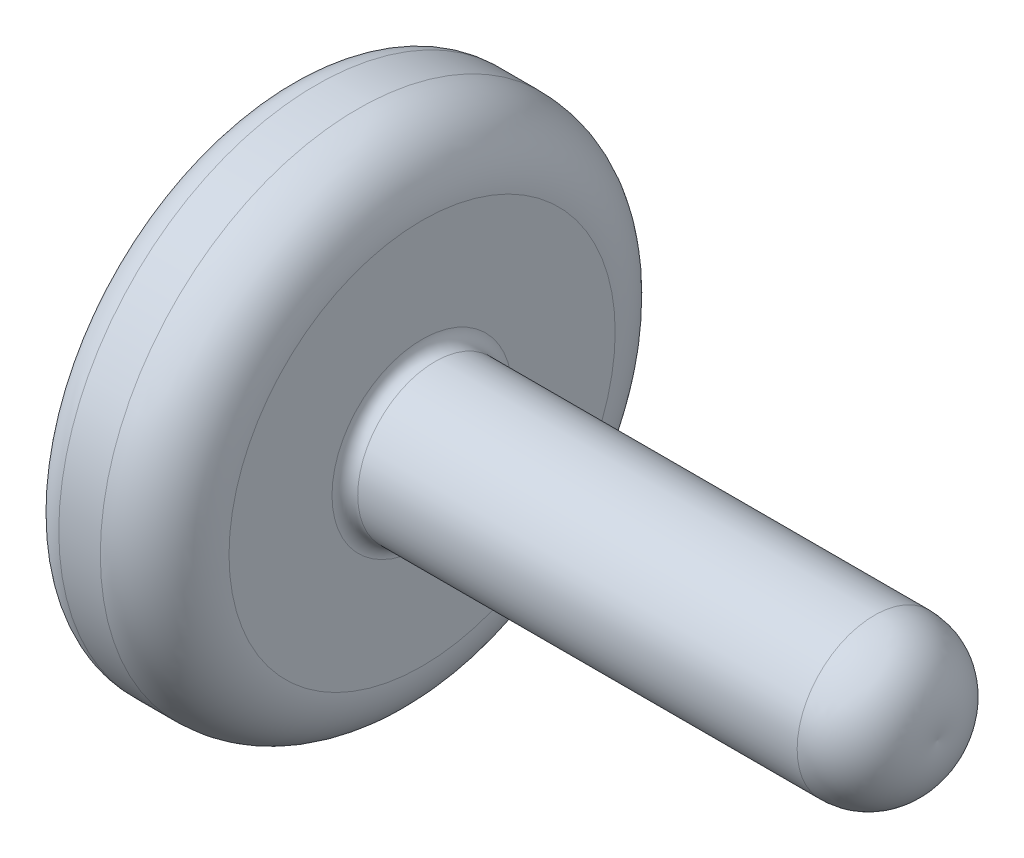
ISO-10303-21;
HEADER;
FILE_DESCRIPTION(('STEP AP214'),'2;1');
FILE_NAME('part.step','',(''),(''),'','','');
FILE_SCHEMA(('AUTOMOTIVE_DESIGN { 1 0 10303 214 1 1 1 1 }'));
ENDSEC;
DATA;
#1=APPLICATION_CONTEXT('core data for automotive mechanical design processes');
#2=APPLICATION_PROTOCOL_DEFINITION('international standard','automotive_design',2000,#1);
#3=PRODUCT_CONTEXT('',#1,'mechanical');
#4=PRODUCT('Part','Part','',(#3));
#5=PRODUCT_RELATED_PRODUCT_CATEGORY('part','',(#4));
#6=PRODUCT_DEFINITION_FORMATION('','',#4);
#7=PRODUCT_DEFINITION_CONTEXT('part definition',#1,'design');
#8=PRODUCT_DEFINITION('design','',#6,#7);
#9=PRODUCT_DEFINITION_SHAPE('','',#8);
#10=(LENGTH_UNIT() NAMED_UNIT(*) SI_UNIT(.MILLI.,.METRE.));
#11=(NAMED_UNIT(*) PLANE_ANGLE_UNIT() SI_UNIT($,.RADIAN.));
#12=(NAMED_UNIT(*) SI_UNIT($,.STERADIAN.) SOLID_ANGLE_UNIT());
#13=UNCERTAINTY_MEASURE_WITH_UNIT(LENGTH_MEASURE(1.E-05),#10,'distance_accuracy_value','');
#14=(GEOMETRIC_REPRESENTATION_CONTEXT(3) GLOBAL_UNCERTAINTY_ASSIGNED_CONTEXT((#13)) GLOBAL_UNIT_ASSIGNED_CONTEXT((#10,
#11,#12)) REPRESENTATION_CONTEXT('',''));
#15=CARTESIAN_POINT('',(0.,0.,0.));
#16=DIRECTION('',(0.,0.,1.));
#17=DIRECTION('',(1.,0.,0.));
#18=AXIS2_PLACEMENT_3D('',#15,#16,#17);
#19=CARTESIAN_POINT('',(4.,0.,0.));
#20=DIRECTION('',(-1.,0.,0.));
#21=DIRECTION('',(0.,1.,0.));
#22=AXIS2_PLACEMENT_3D('',#19,#20,#21);
#23=SPHERICAL_SURFACE('',#22,4.);
#24=CARTESIAN_POINT('',(0.465266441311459,0.,0.));
#25=DIRECTION('',(-1.,0.,0.));
#26=DIRECTION('',(0.,0.,1.));
#27=AXIS2_PLACEMENT_3D('',#24,#25,#26);
#28=CIRCLE('',#27,1.87234042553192);
#29=CARTESIAN_POINT('',(0.465266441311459,0.,1.87234042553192));
#30=VERTEX_POINT('',#29);
#31=EDGE_CURVE('E321',#30,#30,#28,.T.);
#32=ORIENTED_EDGE('',*,*,#31,.T.);
#33=EDGE_LOOP('',(#32));
#34=FACE_BOUND('',#33,.T.);
#35=CARTESIAN_POINT('',(0.0543400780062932,0.,0.));
#36=DIRECTION('',(1.,0.,0.));
#37=DIRECTION('',(0.,0.,-1.));
#38=AXIS2_PLACEMENT_3D('',#35,#36,#37);
#39=CIRCLE('',#38,0.657090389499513);
#40=CARTESIAN_POINT('',(0.0543400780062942,-0.369999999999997,-0.543017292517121));
#41=VERTEX_POINT('',#40);
#42=CARTESIAN_POINT('',(0.0543400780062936,-0.543017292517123,-0.37));
#43=VERTEX_POINT('',#42);
#44=EDGE_CURVE('E457',#41,#43,#39,.F.);
#45=ORIENTED_EDGE('',*,*,#44,.F.);
#46=CARTESIAN_POINT('',(4.,-0.37,0.));
#47=DIRECTION('',(0.,1.,0.));
#48=DIRECTION('',(0.,0.,1.));
#49=AXIS2_PLACEMENT_3D('',#46,#47,#48);
#50=CIRCLE('',#49,3.98285073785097);
#51=CARTESIAN_POINT('',(0.201999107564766,-0.369999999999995,-1.19928696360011));
#52=VERTEX_POINT('',#51);
#53=EDGE_CURVE('E283',#52,#41,#50,.T.);
#54=ORIENTED_EDGE('',*,*,#53,.F.);
#55=CARTESIAN_POINT('',(3.72274316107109,0.,0.556091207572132));
#56=DIRECTION('',(0.446197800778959,0.,-0.89493436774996));
#57=DIRECTION('',(-0.89493436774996,0.,-0.446197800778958));
#58=AXIS2_PLACEMENT_3D('',#55,#56,#57);
#59=CIRCLE('',#58,3.95144166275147);
#60=CARTESIAN_POINT('',(0.201999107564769,0.370000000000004,-1.19928696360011));
#61=VERTEX_POINT('',#60);
#62=EDGE_CURVE('E255',#52,#61,#59,.T.);
#63=ORIENTED_EDGE('',*,*,#62,.T.);
#64=CARTESIAN_POINT('',(4.,0.37,0.));
#65=DIRECTION('',(0.,-1.,0.));
#66=DIRECTION('',(0.,0.,-1.));
#67=AXIS2_PLACEMENT_3D('',#64,#65,#66);
#68=CIRCLE('',#67,3.98285073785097);
#69=CARTESIAN_POINT('',(0.0543400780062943,0.370000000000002,-0.543017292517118));
#70=VERTEX_POINT('',#69);
#71=EDGE_CURVE('E291',#70,#61,#68,.T.);
#72=ORIENTED_EDGE('',*,*,#71,.F.);
#73=CARTESIAN_POINT('',(0.0543400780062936,0.543017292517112,-0.37));
#74=VERTEX_POINT('',#73);
#75=EDGE_CURVE('E370',#74,#70,#39,.F.);
#76=ORIENTED_EDGE('',*,*,#75,.F.);
#77=CARTESIAN_POINT('',(4.,0.,-0.37));
#78=DIRECTION('',(0.,0.,1.));
#79=DIRECTION('',(0.,-1.,0.));
#80=AXIS2_PLACEMENT_3D('',#77,#78,#79);
#81=CIRCLE('',#80,3.98285073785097);
#82=CARTESIAN_POINT('',(0.201999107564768,1.19928696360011,-0.37));
#83=VERTEX_POINT('',#82);
#84=EDGE_CURVE('E249',#83,#74,#81,.T.);
#85=ORIENTED_EDGE('',*,*,#84,.F.);
#86=CARTESIAN_POINT('',(3.72274316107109,-0.556091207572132,0.));
#87=DIRECTION('',(0.446197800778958,0.89493436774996,0.));
#88=DIRECTION('',(-0.89493436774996,0.446197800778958,0.));
#89=AXIS2_PLACEMENT_3D('',#86,#87,#88);
#90=CIRCLE('',#89,3.95144166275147);
#91=CARTESIAN_POINT('',(0.201999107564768,1.19928696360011,0.369999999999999));
#92=VERTEX_POINT('',#91);
#93=EDGE_CURVE('E252',#83,#92,#90,.T.);
#94=ORIENTED_EDGE('',*,*,#93,.T.);
#95=CARTESIAN_POINT('',(4.,0.,0.37));
#96=DIRECTION('',(0.,0.,-1.));
#97=DIRECTION('',(0.,1.,0.));
#98=AXIS2_PLACEMENT_3D('',#95,#96,#97);
#99=CIRCLE('',#98,3.98285073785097);
#100=CARTESIAN_POINT('',(0.0543400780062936,0.543017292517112,0.37));
#101=VERTEX_POINT('',#100);
#102=EDGE_CURVE('E245',#101,#92,#99,.T.);
#103=ORIENTED_EDGE('',*,*,#102,.F.);
#104=CARTESIAN_POINT('',(0.054340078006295,0.369999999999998,0.54301729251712));
#105=VERTEX_POINT('',#104);
#106=EDGE_CURVE('E403',#105,#101,#39,.F.);
#107=ORIENTED_EDGE('',*,*,#106,.F.);
#108=CARTESIAN_POINT('',(0.201999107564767,0.369999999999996,1.19928696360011));
#109=VERTEX_POINT('',#108);
#110=EDGE_CURVE('E265',#109,#105,#68,.T.);
#111=ORIENTED_EDGE('',*,*,#110,.F.);
#112=CARTESIAN_POINT('',(3.72274316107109,0.,-0.556091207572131));
#113=DIRECTION('',(0.446197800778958,0.,0.89493436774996));
#114=DIRECTION('',(0.89493436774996,0.,-0.446197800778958));
#115=AXIS2_PLACEMENT_3D('',#112,#113,#114);
#116=CIRCLE('',#115,3.95144166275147);
#117=CARTESIAN_POINT('',(0.201999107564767,-0.370000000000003,1.19928696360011));
#118=VERTEX_POINT('',#117);
#119=EDGE_CURVE('E40',#109,#118,#116,.T.);
#120=ORIENTED_EDGE('',*,*,#119,.T.);
#121=CARTESIAN_POINT('',(0.0543400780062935,-0.370000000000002,0.543017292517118));
#122=VERTEX_POINT('',#121);
#123=EDGE_CURVE('E262',#122,#118,#50,.T.);
#124=ORIENTED_EDGE('',*,*,#123,.F.);
#125=CARTESIAN_POINT('',(0.0543400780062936,-0.543017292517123,0.369999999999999));
#126=VERTEX_POINT('',#125);
#127=EDGE_CURVE('E442',#126,#122,#39,.F.);
#128=ORIENTED_EDGE('',*,*,#127,.F.);
#129=CARTESIAN_POINT('',(0.201999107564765,-1.19928696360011,0.369999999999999));
#130=VERTEX_POINT('',#129);
#131=EDGE_CURVE('E246',#130,#126,#99,.T.);
#132=ORIENTED_EDGE('',*,*,#131,.F.);
#133=CARTESIAN_POINT('',(3.72274316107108,0.556091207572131,0.));
#134=DIRECTION('',(0.446197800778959,-0.89493436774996,0.));
#135=DIRECTION('',(0.89493436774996,0.446197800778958,0.));
#136=AXIS2_PLACEMENT_3D('',#133,#134,#135);
#137=CIRCLE('',#136,3.95144166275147);
#138=CARTESIAN_POINT('',(0.201999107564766,-1.19928696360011,-0.37));
#139=VERTEX_POINT('',#138);
#140=EDGE_CURVE('E242',#130,#139,#137,.T.);
#141=ORIENTED_EDGE('',*,*,#140,.T.);
#142=EDGE_CURVE('E55',#43,#139,#81,.T.);
#143=ORIENTED_EDGE('',*,*,#142,.F.);
#144=EDGE_LOOP('',(#45,#54,#63,#72,#76,#85,#94,#103,#107,#111,#120,#124,#128,#132,#141,#143));
#145=FACE_BOUND('',#144,.T.);
#146=ADVANCED_FACE('F27',(#34,#145),#23,.T.);
#147=CARTESIAN_POINT('',(1.5,0.552127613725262,-0.37));
#148=DIRECTION('',(0.,0.,1.));
#149=DIRECTION('',(0.,-1.,0.));
#150=AXIS2_PLACEMENT_3D('',#147,#148,#149);
#151=PLANE('',#150);
#152=ORIENTED_EDGE('',*,*,#84,.T.);
#153=CARTESIAN_POINT('',(-0.984107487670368,0.62894390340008,-0.37));
#154=CARTESIAN_POINT('',(-0.783603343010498,0.61266994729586,-0.37));
#155=CARTESIAN_POINT('',(-0.583110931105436,0.596248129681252,-0.37));
#156=CARTESIAN_POINT('',(-0.18215578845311,0.562989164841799,-0.37));
#157=CARTESIAN_POINT('',(0.0183069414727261,0.546152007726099,-0.37));
#158=CARTESIAN_POINT('',(0.419186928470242,0.511943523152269,-0.37));
#159=CARTESIAN_POINT('',(0.619604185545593,0.494572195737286,-0.37));
#160=CARTESIAN_POINT('',(1.02037173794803,0.459102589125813,-0.37));
#161=CARTESIAN_POINT('',(1.2207220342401,0.441004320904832,-0.37));
#162=CARTESIAN_POINT('',(1.53631168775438,0.411665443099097,-0.37));
#163=CARTESIAN_POINT('',(1.65158348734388,0.400774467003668,-0.37));
#164=CARTESIAN_POINT('',(1.88208360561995,0.378547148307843,-0.37));
#165=CARTESIAN_POINT('',(1.99731192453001,0.367210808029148,-0.37));
#166=CARTESIAN_POINT('',(2.22771614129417,0.343963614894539,-0.37));
#167=CARTESIAN_POINT('',(2.34289203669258,0.332052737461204,-0.37));
#168=CARTESIAN_POINT('',(2.57315819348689,0.307413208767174,-0.37));
#169=CARTESIAN_POINT('',(2.68824845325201,0.294684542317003,-0.37));
#170=CARTESIAN_POINT('',(2.80327961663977,0.281425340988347,-0.37));
#171=B_SPLINE_CURVE_WITH_KNOTS('',3,(#153,#154,#155,#156,#157,#158,#159,#160,#161,#162,#163,
#164,#165,#166,#167,#168,#169,#170),.UNSPECIFIED.,.F.,.F.,(4,2,2,2,2,2,2,2,4),(0.,
0.603490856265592,1.20699609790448,1.81050129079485,2.41399737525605,2.76135214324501,
3.1087051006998,3.45607293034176,3.80344721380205),.UNSPECIFIED.);
#172=CARTESIAN_POINT('',(1.5,0.415013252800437,-0.370000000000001));
#173=VERTEX_POINT('',#172);
#174=EDGE_CURVE('E363',#74,#173,#171,.T.);
#175=ORIENTED_EDGE('',*,*,#174,.T.);
#176=DIRECTION('',(0.,1.,0.));
#177=VECTOR('',#176,1.);
#178=CARTESIAN_POINT('',(1.5,-0.552127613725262,-0.37));
#179=LINE('',#178,#177);
#180=CARTESIAN_POINT('',(1.5,0.552127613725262,-0.37));
#181=VERTEX_POINT('',#180);
#182=EDGE_CURVE('E308',#173,#181,#179,.T.);
#183=ORIENTED_EDGE('',*,*,#182,.T.);
#184=DIRECTION('',(0.89493436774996,-0.446197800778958,0.));
#185=VECTOR('',#184,1.);
#186=CARTESIAN_POINT('',(0.,1.3,-0.37));
#187=LINE('',#186,#185);
#188=EDGE_CURVE('E314',#83,#181,#187,.T.);
#189=ORIENTED_EDGE('',*,*,#188,.F.);
#190=EDGE_LOOP('',(#152,#175,#183,#189));
#191=FACE_BOUND('',#190,.T.);
#192=ADVANCED_FACE('F188',(#191),#151,.T.);
#193=CARTESIAN_POINT('',(1.5,-0.552127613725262,-0.37));
#194=VERTEX_POINT('',#193);
#195=CARTESIAN_POINT('',(1.5,-0.415013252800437,-0.370000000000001));
#196=VERTEX_POINT('',#195);
#197=EDGE_CURVE('E305',#194,#196,#179,.T.);
#198=ORIENTED_EDGE('',*,*,#197,.T.);
#199=CARTESIAN_POINT('',(-0.984107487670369,-0.62894390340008,-0.37));
#200=CARTESIAN_POINT('',(-0.783603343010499,-0.61266994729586,-0.37));
#201=CARTESIAN_POINT('',(-0.583110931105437,-0.596248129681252,-0.37));
#202=CARTESIAN_POINT('',(-0.182155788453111,-0.562989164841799,-0.37));
#203=CARTESIAN_POINT('',(0.0183069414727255,-0.5461520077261,-0.37));
#204=CARTESIAN_POINT('',(0.419186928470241,-0.511943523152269,-0.37));
#205=CARTESIAN_POINT('',(0.619604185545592,-0.494572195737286,-0.37));
#206=CARTESIAN_POINT('',(1.02037173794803,-0.459102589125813,-0.37));
#207=CARTESIAN_POINT('',(1.22072203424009,-0.441004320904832,-0.37));
#208=CARTESIAN_POINT('',(1.53631168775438,-0.411665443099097,-0.37));
#209=CARTESIAN_POINT('',(1.65158348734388,-0.400774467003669,-0.37));
#210=CARTESIAN_POINT('',(1.88208360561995,-0.378547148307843,-0.37));
#211=CARTESIAN_POINT('',(1.99731192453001,-0.367210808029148,-0.37));
#212=CARTESIAN_POINT('',(2.22771614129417,-0.343963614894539,-0.37));
#213=CARTESIAN_POINT('',(2.34289203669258,-0.332052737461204,-0.37));
#214=CARTESIAN_POINT('',(2.57315819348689,-0.307413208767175,-0.37));
#215=CARTESIAN_POINT('',(2.68824845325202,-0.294684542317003,-0.37));
#216=CARTESIAN_POINT('',(2.80327961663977,-0.281425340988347,-0.37));
#217=B_SPLINE_CURVE_WITH_KNOTS('',3,(#199,#200,#201,#202,#203,#204,#205,#206,#207,#208,#209,
#210,#211,#212,#213,#214,#215,#216),.UNSPECIFIED.,.F.,.F.,(4,2,2,2,2,2,2,2,4),(0.,
0.603490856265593,1.20699609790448,1.81050129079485,2.41399737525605,2.76135214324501,
3.1087051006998,3.45607293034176,3.80344721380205),.UNSPECIFIED.);
#218=EDGE_CURVE('E356',#196,#43,#217,.F.);
#219=ORIENTED_EDGE('',*,*,#218,.T.);
#220=ORIENTED_EDGE('',*,*,#142,.T.);
#221=DIRECTION('',(0.89493436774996,0.446197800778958,0.));
#222=VECTOR('',#221,1.);
#223=CARTESIAN_POINT('',(0.,-1.3,-0.37));
#224=LINE('',#223,#222);
#225=EDGE_CURVE('E311',#139,#194,#224,.T.);
#226=ORIENTED_EDGE('',*,*,#225,.T.);
#227=EDGE_LOOP('',(#198,#219,#220,#226));
#228=FACE_BOUND('',#227,.T.);
#229=ADVANCED_FACE('F195',(#228),#151,.T.);
#230=CARTESIAN_POINT('',(1.5,-0.552127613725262,0.369999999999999));
#231=DIRECTION('',(0.,0.,-1.));
#232=DIRECTION('',(0.,1.,0.));
#233=AXIS2_PLACEMENT_3D('',#230,#231,#232);
#234=PLANE('',#233);
#235=DIRECTION('',(0.,-1.,0.));
#236=VECTOR('',#235,1.);
#237=CARTESIAN_POINT('',(1.5,0.552127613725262,0.37));
#238=LINE('',#237,#236);
#239=CARTESIAN_POINT('',(1.5,0.552127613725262,0.37));
#240=VERTEX_POINT('',#239);
#241=CARTESIAN_POINT('',(1.5,0.415013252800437,0.370000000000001));
#242=VERTEX_POINT('',#241);
#243=EDGE_CURVE('E297',#240,#242,#238,.T.);
#244=ORIENTED_EDGE('',*,*,#243,.T.);
#245=CARTESIAN_POINT('',(-0.984107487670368,0.62894390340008,0.37));
#246=CARTESIAN_POINT('',(-0.783603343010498,0.61266994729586,0.37));
#247=CARTESIAN_POINT('',(-0.583110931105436,0.596248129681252,0.37));
#248=CARTESIAN_POINT('',(-0.18215578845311,0.562989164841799,0.37));
#249=CARTESIAN_POINT('',(0.0183069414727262,0.5461520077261,0.37));
#250=CARTESIAN_POINT('',(0.419186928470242,0.511943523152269,0.37));
#251=CARTESIAN_POINT('',(0.619604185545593,0.494572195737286,0.37));
#252=CARTESIAN_POINT('',(1.02037173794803,0.459102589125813,0.37));
#253=CARTESIAN_POINT('',(1.22072203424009,0.441004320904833,0.37));
#254=CARTESIAN_POINT('',(1.53631168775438,0.411665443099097,0.37));
#255=CARTESIAN_POINT('',(1.65158348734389,0.400774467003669,0.37));
#256=CARTESIAN_POINT('',(1.88208360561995,0.378547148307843,0.37));
#257=CARTESIAN_POINT('',(1.99731192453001,0.367210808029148,0.37));
#258=CARTESIAN_POINT('',(2.22771614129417,0.343963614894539,0.37));
#259=CARTESIAN_POINT('',(2.34289203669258,0.332052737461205,0.37));
#260=CARTESIAN_POINT('',(2.57315819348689,0.307413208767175,0.37));
#261=CARTESIAN_POINT('',(2.68824845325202,0.294684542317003,0.37));
#262=CARTESIAN_POINT('',(2.80327961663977,0.281425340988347,0.37));
#263=B_SPLINE_CURVE_WITH_KNOTS('',3,(#245,#246,#247,#248,#249,#250,#251,#252,#253,#254,#255,
#256,#257,#258,#259,#260,#261,#262),.UNSPECIFIED.,.F.,.F.,(4,2,2,2,2,2,2,2,4),(0.,
0.603490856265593,1.20699609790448,1.81050129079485,2.41399737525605,2.76135214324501,
3.1087051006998,3.45607293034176,3.80344721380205),.UNSPECIFIED.);
#264=EDGE_CURVE('E404',#242,#101,#263,.F.);
#265=ORIENTED_EDGE('',*,*,#264,.T.);
#266=ORIENTED_EDGE('',*,*,#102,.T.);
#267=DIRECTION('',(0.89493436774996,-0.446197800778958,0.));
#268=VECTOR('',#267,1.);
#269=CARTESIAN_POINT('',(0.,1.3,0.37));
#270=LINE('',#269,#268);
#271=EDGE_CURVE('E313',#92,#240,#270,.T.);
#272=ORIENTED_EDGE('',*,*,#271,.T.);
#273=EDGE_LOOP('',(#244,#265,#266,#272));
#274=FACE_BOUND('',#273,.T.);
#275=ADVANCED_FACE('F351',(#274),#234,.T.);
#276=ORIENTED_EDGE('',*,*,#131,.T.);
#277=CARTESIAN_POINT('',(-0.984107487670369,-0.62894390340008,0.369999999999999));
#278=CARTESIAN_POINT('',(-0.783603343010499,-0.612669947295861,0.369999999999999));
#279=CARTESIAN_POINT('',(-0.583110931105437,-0.596248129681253,0.369999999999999));
#280=CARTESIAN_POINT('',(-0.18215578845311,-0.5629891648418,0.369999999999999));
#281=CARTESIAN_POINT('',(0.0183069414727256,-0.5461520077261,0.369999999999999));
#282=CARTESIAN_POINT('',(0.419186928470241,-0.511943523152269,0.369999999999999));
#283=CARTESIAN_POINT('',(0.619604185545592,-0.494572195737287,0.369999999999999));
#284=CARTESIAN_POINT('',(1.02037173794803,-0.459102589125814,0.369999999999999));
#285=CARTESIAN_POINT('',(1.22072203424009,-0.441004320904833,0.369999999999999));
#286=CARTESIAN_POINT('',(1.53631168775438,-0.411665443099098,0.369999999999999));
#287=CARTESIAN_POINT('',(1.65158348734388,-0.400774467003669,0.37));
#288=CARTESIAN_POINT('',(1.88208360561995,-0.378547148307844,0.37));
#289=CARTESIAN_POINT('',(1.99731192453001,-0.367210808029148,0.37));
#290=CARTESIAN_POINT('',(2.22771614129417,-0.34396361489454,0.37));
#291=CARTESIAN_POINT('',(2.34289203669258,-0.332052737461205,0.37));
#292=CARTESIAN_POINT('',(2.57315819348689,-0.307413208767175,0.37));
#293=CARTESIAN_POINT('',(2.68824845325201,-0.294684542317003,0.37));
#294=CARTESIAN_POINT('',(2.80327961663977,-0.281425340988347,0.37));
#295=B_SPLINE_CURVE_WITH_KNOTS('',3,(#277,#278,#279,#280,#281,#282,#283,#284,#285,#286,#287,
#288,#289,#290,#291,#292,#293,#294),.UNSPECIFIED.,.F.,.F.,(4,2,2,2,2,2,2,2,4),(0.,
0.603490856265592,1.20699609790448,1.81050129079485,2.41399737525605,2.76135214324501,
3.1087051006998,3.45607293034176,3.80344721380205),.UNSPECIFIED.);
#296=CARTESIAN_POINT('',(1.5,-0.415013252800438,0.37));
#297=VERTEX_POINT('',#296);
#298=EDGE_CURVE('E394',#126,#297,#295,.T.);
#299=ORIENTED_EDGE('',*,*,#298,.T.);
#300=CARTESIAN_POINT('',(1.5,-0.552127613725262,0.369999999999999));
#301=VERTEX_POINT('',#300);
#302=EDGE_CURVE('E300',#297,#301,#238,.T.);
#303=ORIENTED_EDGE('',*,*,#302,.T.);
#304=DIRECTION('',(0.89493436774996,0.446197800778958,0.));
#305=VECTOR('',#304,1.);
#306=CARTESIAN_POINT('',(0.,-1.3,0.369999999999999));
#307=LINE('',#306,#305);
#308=EDGE_CURVE('E295',#130,#301,#307,.T.);
#309=ORIENTED_EDGE('',*,*,#308,.F.);
#310=EDGE_LOOP('',(#276,#299,#303,#309));
#311=FACE_BOUND('',#310,.T.);
#312=ADVANCED_FACE('F347',(#311),#234,.T.);
#313=CARTESIAN_POINT('',(1.5,0.552127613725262,0.37));
#314=DIRECTION('',(0.446197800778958,0.89493436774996,0.));
#315=DIRECTION('',(-0.89493436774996,0.446197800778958,0.));
#316=AXIS2_PLACEMENT_3D('',#313,#314,#315);
#317=PLANE('',#316);
#318=CARTESIAN_POINT('',(2.47007520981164,0.0684659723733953,0.));
#319=DIRECTION('',(0.446197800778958,0.89493436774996,0.));
#320=DIRECTION('',(-0.89493436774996,0.446197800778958,0.));
#321=AXIS2_PLACEMENT_3D('',#318,#319,#320);
#322=ELLIPSE('',#321,1.09405678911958,0.483340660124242);
#323=CARTESIAN_POINT('',(1.5,0.552127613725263,0.0655064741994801));
#324=VERTEX_POINT('',#323);
#325=CARTESIAN_POINT('',(1.5,0.552127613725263,-0.0655064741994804));
#326=VERTEX_POINT('',#325);
#327=EDGE_CURVE('E434',#324,#326,#322,.F.);
#328=ORIENTED_EDGE('',*,*,#327,.F.);
#329=DIRECTION('',(0.,0.,-1.));
#330=VECTOR('',#329,1.);
#331=CARTESIAN_POINT('',(1.5,0.552127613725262,0.37));
#332=LINE('',#331,#330);
#333=EDGE_CURVE('E301',#240,#324,#332,.T.);
#334=ORIENTED_EDGE('',*,*,#333,.F.);
#335=ORIENTED_EDGE('',*,*,#271,.F.);
#336=ORIENTED_EDGE('',*,*,#93,.F.);
#337=ORIENTED_EDGE('',*,*,#188,.T.);
#338=EDGE_CURVE('E304',#326,#181,#332,.T.);
#339=ORIENTED_EDGE('',*,*,#338,.F.);
#340=EDGE_LOOP('',(#328,#334,#335,#336,#337,#339));
#341=FACE_BOUND('',#340,.T.);
#342=ADVANCED_FACE('F344',(#341),#317,.F.);
#343=CARTESIAN_POINT('',(0.,-1.3,-0.37));
#344=DIRECTION('',(0.446197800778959,-0.89493436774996,0.));
#345=DIRECTION('',(0.89493436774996,0.446197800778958,0.));
#346=AXIS2_PLACEMENT_3D('',#343,#344,#345);
#347=PLANE('',#346);
#348=CARTESIAN_POINT('',(2.47007520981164,-0.0684659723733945,0.));
#349=DIRECTION('',(0.446197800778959,-0.89493436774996,0.));
#350=DIRECTION('',(-0.89493436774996,-0.446197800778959,0.));
#351=AXIS2_PLACEMENT_3D('',#348,#349,#350);
#352=ELLIPSE('',#351,1.09405678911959,0.483340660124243);
#353=CARTESIAN_POINT('',(1.5,-0.552127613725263,-0.0655064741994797));
#354=VERTEX_POINT('',#353);
#355=CARTESIAN_POINT('',(1.5,-0.552127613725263,0.0655064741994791));
#356=VERTEX_POINT('',#355);
#357=EDGE_CURVE('E430',#354,#356,#352,.F.);
#358=ORIENTED_EDGE('',*,*,#357,.F.);
#359=DIRECTION('',(0.,0.,1.));
#360=VECTOR('',#359,1.);
#361=CARTESIAN_POINT('',(1.5,-0.552127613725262,-0.37));
#362=LINE('',#361,#360);
#363=EDGE_CURVE('E292',#194,#354,#362,.T.);
#364=ORIENTED_EDGE('',*,*,#363,.F.);
#365=ORIENTED_EDGE('',*,*,#225,.F.);
#366=ORIENTED_EDGE('',*,*,#140,.F.);
#367=ORIENTED_EDGE('',*,*,#308,.T.);
#368=EDGE_CURVE('E296',#356,#301,#362,.T.);
#369=ORIENTED_EDGE('',*,*,#368,.F.);
#370=EDGE_LOOP('',(#358,#364,#365,#366,#367,#369));
#371=FACE_BOUND('',#370,.T.);
#372=ADVANCED_FACE('F346',(#371),#347,.F.);
#373=CARTESIAN_POINT('',(1.5,0.552127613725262,-0.37));
#374=DIRECTION('',(-1.,0.,0.));
#375=DIRECTION('',(0.,0.,1.));
#376=AXIS2_PLACEMENT_3D('',#373,#374,#375);
#377=PLANE('',#376);
#378=DIRECTION('',(0.,1.,0.));
#379=VECTOR('',#378,1.);
#380=CARTESIAN_POINT('',(1.5,-0.370000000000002,0.55212761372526));
#381=LINE('',#380,#379);
#382=CARTESIAN_POINT('',(1.5,-0.370000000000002,0.55212761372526));
#383=VERTEX_POINT('',#382);
#384=CARTESIAN_POINT('',(1.5,-0.0655064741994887,0.552127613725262));
#385=VERTEX_POINT('',#384);
#386=EDGE_CURVE('E498',#383,#385,#381,.T.);
#387=ORIENTED_EDGE('',*,*,#386,.T.);
#388=CARTESIAN_POINT('',(1.5,0.,0.));
#389=DIRECTION('',(-1.,0.,0.));
#390=DIRECTION('',(0.,0.,1.));
#391=AXIS2_PLACEMENT_3D('',#388,#389,#390);
#392=CIRCLE('',#391,0.556);
#393=CARTESIAN_POINT('',(1.5,-0.370000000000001,0.415013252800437));
#394=VERTEX_POINT('',#393);
#395=EDGE_CURVE('E455',#394,#385,#392,.T.);
#396=ORIENTED_EDGE('',*,*,#395,.F.);
#397=DIRECTION('',(0.,0.,-1.));
#398=VECTOR('',#397,1.);
#399=CARTESIAN_POINT('',(1.5,-0.370000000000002,0.55212761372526));
#400=LINE('',#399,#398);
#401=EDGE_CURVE('E493',#383,#394,#400,.T.);
#402=ORIENTED_EDGE('',*,*,#401,.F.);
#403=EDGE_LOOP('',(#387,#396,#402));
#404=FACE_BOUND('',#403,.T.);
#405=ADVANCED_FACE('F419',(#404),#377,.T.);
#406=ORIENTED_EDGE('',*,*,#302,.F.);
#407=EDGE_CURVE('E450',#356,#297,#392,.T.);
#408=ORIENTED_EDGE('',*,*,#407,.F.);
#409=ORIENTED_EDGE('',*,*,#368,.T.);
#410=EDGE_LOOP('',(#406,#408,#409));
#411=FACE_BOUND('',#410,.T.);
#412=ADVANCED_FACE('F421',(#411),#377,.T.);
#413=ORIENTED_EDGE('',*,*,#363,.T.);
#414=EDGE_CURVE('E439',#196,#354,#392,.T.);
#415=ORIENTED_EDGE('',*,*,#414,.F.);
#416=ORIENTED_EDGE('',*,*,#197,.F.);
#417=EDGE_LOOP('',(#413,#415,#416));
#418=FACE_BOUND('',#417,.T.);
#419=ADVANCED_FACE('F437',(#418),#377,.T.);
#420=CARTESIAN_POINT('',(1.5,-0.369999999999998,-0.415013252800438));
#421=VERTEX_POINT('',#420);
#422=CARTESIAN_POINT('',(1.5,-0.369999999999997,-0.552127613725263));
#423=VERTEX_POINT('',#422);
#424=EDGE_CURVE('E487',#421,#423,#400,.T.);
#425=ORIENTED_EDGE('',*,*,#424,.F.);
#426=CARTESIAN_POINT('',(1.5,-0.0655064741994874,-0.552127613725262));
#427=VERTEX_POINT('',#426);
#428=EDGE_CURVE('E47',#427,#421,#392,.T.);
#429=ORIENTED_EDGE('',*,*,#428,.F.);
#430=DIRECTION('',(0.,-1.,0.));
#431=VECTOR('',#430,1.);
#432=CARTESIAN_POINT('',(1.5,0.370000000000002,-0.55212761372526));
#433=LINE('',#432,#431);
#434=EDGE_CURVE('E485',#427,#423,#433,.T.);
#435=ORIENTED_EDGE('',*,*,#434,.T.);
#436=EDGE_LOOP('',(#425,#429,#435));
#437=FACE_BOUND('',#436,.T.);
#438=ADVANCED_FACE('F484',(#437),#377,.T.);
#439=CARTESIAN_POINT('',(1.5,0.370000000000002,-0.55212761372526));
#440=VERTEX_POINT('',#439);
#441=CARTESIAN_POINT('',(1.5,0.0655064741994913,-0.552127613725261));
#442=VERTEX_POINT('',#441);
#443=EDGE_CURVE('E492',#440,#442,#433,.T.);
#444=ORIENTED_EDGE('',*,*,#443,.T.);
#445=CARTESIAN_POINT('',(1.5,0.370000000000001,-0.415013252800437));
#446=VERTEX_POINT('',#445);
#447=EDGE_CURVE('E481',#446,#442,#392,.T.);
#448=ORIENTED_EDGE('',*,*,#447,.F.);
#449=DIRECTION('',(0.,0.,1.));
#450=VECTOR('',#449,1.);
#451=CARTESIAN_POINT('',(1.5,0.370000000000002,-0.55212761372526));
#452=LINE('',#451,#450);
#453=EDGE_CURVE('E502',#440,#446,#452,.T.);
#454=ORIENTED_EDGE('',*,*,#453,.F.);
#455=EDGE_LOOP('',(#444,#448,#454));
#456=FACE_BOUND('',#455,.T.);
#457=ADVANCED_FACE('F509',(#456),#377,.T.);
#458=ORIENTED_EDGE('',*,*,#182,.F.);
#459=EDGE_CURVE('E511',#326,#173,#392,.T.);
#460=ORIENTED_EDGE('',*,*,#459,.F.);
#461=ORIENTED_EDGE('',*,*,#338,.T.);
#462=EDGE_LOOP('',(#458,#460,#461));
#463=FACE_BOUND('',#462,.T.);
#464=ADVANCED_FACE('F537',(#463),#377,.T.);
#465=ORIENTED_EDGE('',*,*,#333,.T.);
#466=EDGE_CURVE('E516',#242,#324,#392,.T.);
#467=ORIENTED_EDGE('',*,*,#466,.F.);
#468=ORIENTED_EDGE('',*,*,#243,.F.);
#469=EDGE_LOOP('',(#465,#467,#468));
#470=FACE_BOUND('',#469,.T.);
#471=ADVANCED_FACE('F525',(#470),#377,.T.);
#472=CARTESIAN_POINT('',(1.5,0.369999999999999,0.415013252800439));
#473=VERTEX_POINT('',#472);
#474=CARTESIAN_POINT('',(1.5,0.369999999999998,0.552127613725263));
#475=VERTEX_POINT('',#474);
#476=EDGE_CURVE('E280',#473,#475,#452,.T.);
#477=ORIENTED_EDGE('',*,*,#476,.F.);
#478=CARTESIAN_POINT('',(1.5,0.0655064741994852,0.552127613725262));
#479=VERTEX_POINT('',#478);
#480=EDGE_CURVE('E456',#479,#473,#392,.T.);
#481=ORIENTED_EDGE('',*,*,#480,.F.);
#482=EDGE_CURVE('E501',#479,#475,#381,.T.);
#483=ORIENTED_EDGE('',*,*,#482,.T.);
#484=EDGE_LOOP('',(#477,#481,#483));
#485=FACE_BOUND('',#484,.T.);
#486=ADVANCED_FACE('F413',(#485),#377,.T.);
#487=CARTESIAN_POINT('',(1.5,0.369999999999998,0.552127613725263));
#488=DIRECTION('',(0.,-1.,0.));
#489=DIRECTION('',(0.,0.,-1.));
#490=AXIS2_PLACEMENT_3D('',#487,#488,#489);
#491=PLANE('',#490);
#492=ORIENTED_EDGE('',*,*,#110,.T.);
#493=CARTESIAN_POINT('',(-0.98410748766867,0.369999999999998,0.628943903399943));
#494=CARTESIAN_POINT('',(-0.783603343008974,0.369999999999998,0.612669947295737));
#495=CARTESIAN_POINT('',(-0.583110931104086,0.369999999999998,0.596248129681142));
#496=CARTESIAN_POINT('',(-0.182155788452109,0.369999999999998,0.562989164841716));
#497=CARTESIAN_POINT('',(0.0183069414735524,0.369999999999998,0.546152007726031));
#498=CARTESIAN_POINT('',(0.419186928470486,0.369999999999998,0.511943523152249));
#499=CARTESIAN_POINT('',(0.619604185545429,0.369999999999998,0.494572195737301));
#500=CARTESIAN_POINT('',(1.02037173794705,0.369999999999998,0.459102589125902));
#501=CARTESIAN_POINT('',(1.22072203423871,0.369999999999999,0.44100432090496));
#502=CARTESIAN_POINT('',(1.53631168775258,0.369999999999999,0.411665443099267));
#503=CARTESIAN_POINT('',(1.65158348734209,0.369999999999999,0.40077446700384));
#504=CARTESIAN_POINT('',(1.88208360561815,0.369999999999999,0.378547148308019));
#505=CARTESIAN_POINT('',(1.99731192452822,0.369999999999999,0.367210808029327));
#506=CARTESIAN_POINT('',(2.22771614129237,0.369999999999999,0.343963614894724));
#507=CARTESIAN_POINT('',(2.34289203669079,0.369999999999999,0.332052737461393));
#508=CARTESIAN_POINT('',(2.5731581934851,0.369999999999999,0.307413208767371));
#509=CARTESIAN_POINT('',(2.68824845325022,0.369999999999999,0.294684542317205));
#510=CARTESIAN_POINT('',(2.80327961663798,0.369999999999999,0.281425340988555));
#511=B_SPLINE_CURVE_WITH_KNOTS('',3,(#493,#494,#495,#496,#497,#498,#499,#500,#501,#502,#503,
#504,#505,#506,#507,#508,#509,#510),.UNSPECIFIED.,.F.,.F.,(4,2,2,2,2,2,2,2,4),(0.,
0.603490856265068,1.20699609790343,1.81050129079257,2.41399737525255,2.7613521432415,
3.1087051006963,3.45607293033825,3.80344721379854),.UNSPECIFIED.);
#512=EDGE_CURVE('E399',#105,#473,#511,.T.);
#513=ORIENTED_EDGE('',*,*,#512,.T.);
#514=ORIENTED_EDGE('',*,*,#476,.T.);
#515=DIRECTION('',(0.89493436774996,0.,-0.446197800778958));
#516=VECTOR('',#515,1.);
#517=CARTESIAN_POINT('',(0.,0.369999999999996,1.3));
#518=LINE('',#517,#516);
#519=EDGE_CURVE('E273',#109,#475,#518,.T.);
#520=ORIENTED_EDGE('',*,*,#519,.F.);
#521=EDGE_LOOP('',(#492,#513,#514,#520));
#522=FACE_BOUND('',#521,.T.);
#523=ADVANCED_FACE('F277',(#522),#491,.T.);
#524=CARTESIAN_POINT('',(1.5,-0.369999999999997,-0.552127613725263));
#525=DIRECTION('',(0.,1.,0.));
#526=DIRECTION('',(0.,0.,1.));
#527=AXIS2_PLACEMENT_3D('',#524,#525,#526);
#528=PLANE('',#527);
#529=ORIENTED_EDGE('',*,*,#401,.T.);
#530=CARTESIAN_POINT('',(-0.984107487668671,-0.370000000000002,0.628943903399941));
#531=CARTESIAN_POINT('',(-0.783603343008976,-0.370000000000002,0.612669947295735));
#532=CARTESIAN_POINT('',(-0.583110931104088,-0.370000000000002,0.59624812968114));
#533=CARTESIAN_POINT('',(-0.18215578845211,-0.370000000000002,0.562989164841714));
#534=CARTESIAN_POINT('',(0.0183069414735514,-0.370000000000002,0.546152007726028));
#535=CARTESIAN_POINT('',(0.419186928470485,-0.370000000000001,0.511943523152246));
#536=CARTESIAN_POINT('',(0.619604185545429,-0.370000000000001,0.494572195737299));
#537=CARTESIAN_POINT('',(1.02037173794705,-0.370000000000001,0.4591025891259));
#538=CARTESIAN_POINT('',(1.22072203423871,-0.370000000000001,0.441004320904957));
#539=CARTESIAN_POINT('',(1.53631168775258,-0.370000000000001,0.411665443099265));
#540=CARTESIAN_POINT('',(1.65158348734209,-0.370000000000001,0.400774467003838));
#541=CARTESIAN_POINT('',(1.88208360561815,-0.370000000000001,0.378547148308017));
#542=CARTESIAN_POINT('',(1.99731192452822,-0.370000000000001,0.367210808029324));
#543=CARTESIAN_POINT('',(2.22771614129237,-0.370000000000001,0.343963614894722));
#544=CARTESIAN_POINT('',(2.34289203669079,-0.370000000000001,0.332052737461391));
#545=CARTESIAN_POINT('',(2.5731581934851,-0.370000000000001,0.307413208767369));
#546=CARTESIAN_POINT('',(2.68824845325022,-0.370000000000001,0.294684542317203));
#547=CARTESIAN_POINT('',(2.80327961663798,-0.370000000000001,0.281425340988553));
#548=B_SPLINE_CURVE_WITH_KNOTS('',3,(#530,#531,#532,#533,#534,#535,#536,#537,#538,#539,#540,
#541,#542,#543,#544,#545,#546,#547),.UNSPECIFIED.,.F.,.F.,(4,2,2,2,2,2,2,2,4),(0.,
0.603490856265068,1.20699609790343,1.81050129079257,2.41399737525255,2.7613521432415,
3.1087051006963,3.45607293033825,3.80344721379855),.UNSPECIFIED.);
#549=EDGE_CURVE('E389',#394,#122,#548,.F.);
#550=ORIENTED_EDGE('',*,*,#549,.T.);
#551=ORIENTED_EDGE('',*,*,#123,.T.);
#552=DIRECTION('',(0.89493436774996,0.,-0.446197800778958));
#553=VECTOR('',#552,1.);
#554=CARTESIAN_POINT('',(0.,-0.370000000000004,1.3));
#555=LINE('',#554,#553);
#556=EDGE_CURVE('E275',#118,#383,#555,.T.);
#557=ORIENTED_EDGE('',*,*,#556,.T.);
#558=EDGE_LOOP('',(#529,#550,#551,#557));
#559=FACE_BOUND('',#558,.T.);
#560=ADVANCED_FACE('F412',(#559),#528,.T.);
#561=CARTESIAN_POINT('',(1.5,-0.370000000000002,0.55212761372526));
#562=DIRECTION('',(0.446197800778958,0.,0.89493436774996));
#563=DIRECTION('',(-0.89493436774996,0.,0.446197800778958));
#564=AXIS2_PLACEMENT_3D('',#561,#562,#563);
#565=PLANE('',#564);
#566=CARTESIAN_POINT('',(2.47007520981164,0.,0.0684659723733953));
#567=DIRECTION('',(0.446197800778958,0.,0.89493436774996));
#568=DIRECTION('',(-0.89493436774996,0.,0.446197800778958));
#569=AXIS2_PLACEMENT_3D('',#566,#567,#568);
#570=ELLIPSE('',#569,1.09405678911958,0.483340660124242);
#571=EDGE_CURVE('E465',#385,#479,#570,.F.);
#572=ORIENTED_EDGE('',*,*,#571,.F.);
#573=ORIENTED_EDGE('',*,*,#386,.F.);
#574=ORIENTED_EDGE('',*,*,#556,.F.);
#575=ORIENTED_EDGE('',*,*,#119,.F.);
#576=ORIENTED_EDGE('',*,*,#519,.T.);
#577=ORIENTED_EDGE('',*,*,#482,.F.);
#578=EDGE_LOOP('',(#572,#573,#574,#575,#576,#577));
#579=FACE_BOUND('',#578,.T.);
#580=ADVANCED_FACE('F271',(#579),#565,.F.);
#581=CARTESIAN_POINT('',(0.,0.370000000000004,-1.3));
#582=DIRECTION('',(0.446197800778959,0.,-0.89493436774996));
#583=DIRECTION('',(0.89493436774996,0.,0.446197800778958));
#584=AXIS2_PLACEMENT_3D('',#581,#582,#583);
#585=PLANE('',#584);
#586=CARTESIAN_POINT('',(2.47007520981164,0.,-0.0684659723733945));
#587=DIRECTION('',(0.446197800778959,0.,-0.89493436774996));
#588=DIRECTION('',(-0.89493436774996,0.,-0.446197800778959));
#589=AXIS2_PLACEMENT_3D('',#586,#587,#588);
#590=ELLIPSE('',#589,1.09405678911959,0.483340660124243);
#591=EDGE_CURVE('E369',#442,#427,#590,.F.);
#592=ORIENTED_EDGE('',*,*,#591,.F.);
#593=ORIENTED_EDGE('',*,*,#443,.F.);
#594=DIRECTION('',(0.89493436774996,0.,0.446197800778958));
#595=VECTOR('',#594,1.);
#596=CARTESIAN_POINT('',(0.,0.370000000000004,-1.3));
#597=LINE('',#596,#595);
#598=EDGE_CURVE('E285',#61,#440,#597,.T.);
#599=ORIENTED_EDGE('',*,*,#598,.F.);
#600=ORIENTED_EDGE('',*,*,#62,.F.);
#601=DIRECTION('',(0.89493436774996,0.,0.446197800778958));
#602=VECTOR('',#601,1.);
#603=CARTESIAN_POINT('',(0.,-0.369999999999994,-1.3));
#604=LINE('',#603,#602);
#605=EDGE_CURVE('E491',#52,#423,#604,.T.);
#606=ORIENTED_EDGE('',*,*,#605,.T.);
#607=ORIENTED_EDGE('',*,*,#434,.F.);
#608=EDGE_LOOP('',(#592,#593,#599,#600,#606,#607));
#609=FACE_BOUND('',#608,.T.);
#610=ADVANCED_FACE('F379',(#609),#585,.F.);
#611=ORIENTED_EDGE('',*,*,#453,.T.);
#612=CARTESIAN_POINT('',(-0.984107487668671,0.370000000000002,-0.628943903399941));
#613=CARTESIAN_POINT('',(-0.783603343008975,0.370000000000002,-0.612669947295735));
#614=CARTESIAN_POINT('',(-0.583110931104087,0.370000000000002,-0.59624812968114));
#615=CARTESIAN_POINT('',(-0.18215578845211,0.370000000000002,-0.562989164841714));
#616=CARTESIAN_POINT('',(0.0183069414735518,0.370000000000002,-0.546152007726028));
#617=CARTESIAN_POINT('',(0.419186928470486,0.370000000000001,-0.511943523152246));
#618=CARTESIAN_POINT('',(0.619604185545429,0.370000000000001,-0.494572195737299));
#619=CARTESIAN_POINT('',(1.02037173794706,0.370000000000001,-0.459102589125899));
#620=CARTESIAN_POINT('',(1.22072203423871,0.370000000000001,-0.441004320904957));
#621=CARTESIAN_POINT('',(1.53631168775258,0.370000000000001,-0.411665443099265));
#622=CARTESIAN_POINT('',(1.65158348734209,0.370000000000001,-0.400774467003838));
#623=CARTESIAN_POINT('',(1.88208360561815,0.370000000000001,-0.378547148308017));
#624=CARTESIAN_POINT('',(1.99731192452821,0.370000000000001,-0.367210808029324));
#625=CARTESIAN_POINT('',(2.22771614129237,0.370000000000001,-0.343963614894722));
#626=CARTESIAN_POINT('',(2.34289203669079,0.370000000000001,-0.332052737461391));
#627=CARTESIAN_POINT('',(2.5731581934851,0.370000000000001,-0.307413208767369));
#628=CARTESIAN_POINT('',(2.68824845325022,0.370000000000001,-0.294684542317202));
#629=CARTESIAN_POINT('',(2.80327961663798,0.370000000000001,-0.281425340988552));
#630=B_SPLINE_CURVE_WITH_KNOTS('',3,(#612,#613,#614,#615,#616,#617,#618,#619,#620,#621,#622,
#623,#624,#625,#626,#627,#628,#629),.UNSPECIFIED.,.F.,.F.,(4,2,2,2,2,2,2,2,4),(0.,
0.603490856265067,1.20699609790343,1.81050129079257,2.41399737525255,2.7613521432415,
3.1087051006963,3.45607293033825,3.80344721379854),.UNSPECIFIED.);
#631=EDGE_CURVE('E371',#446,#70,#630,.F.);
#632=ORIENTED_EDGE('',*,*,#631,.T.);
#633=ORIENTED_EDGE('',*,*,#71,.T.);
#634=ORIENTED_EDGE('',*,*,#598,.T.);
#635=EDGE_LOOP('',(#611,#632,#633,#634));
#636=FACE_BOUND('',#635,.T.);
#637=ADVANCED_FACE('F414',(#636),#491,.T.);
#638=ORIENTED_EDGE('',*,*,#53,.T.);
#639=CARTESIAN_POINT('',(-0.984107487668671,-0.369999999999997,-0.628943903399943));
#640=CARTESIAN_POINT('',(-0.783603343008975,-0.369999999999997,-0.612669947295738));
#641=CARTESIAN_POINT('',(-0.583110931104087,-0.369999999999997,-0.596248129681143));
#642=CARTESIAN_POINT('',(-0.18215578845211,-0.369999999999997,-0.562989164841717));
#643=CARTESIAN_POINT('',(0.0183069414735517,-0.369999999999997,-0.546152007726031));
#644=CARTESIAN_POINT('',(0.419186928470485,-0.369999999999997,-0.511943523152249));
#645=CARTESIAN_POINT('',(0.619604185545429,-0.369999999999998,-0.494572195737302));
#646=CARTESIAN_POINT('',(1.02037173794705,-0.369999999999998,-0.459102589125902));
#647=CARTESIAN_POINT('',(1.22072203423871,-0.369999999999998,-0.44100432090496));
#648=CARTESIAN_POINT('',(1.53631168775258,-0.369999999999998,-0.411665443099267));
#649=CARTESIAN_POINT('',(1.65158348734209,-0.369999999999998,-0.400774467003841));
#650=CARTESIAN_POINT('',(1.88208360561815,-0.369999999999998,-0.37854714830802));
#651=CARTESIAN_POINT('',(1.99731192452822,-0.369999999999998,-0.367210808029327));
#652=CARTESIAN_POINT('',(2.22771614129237,-0.369999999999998,-0.343963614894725));
#653=CARTESIAN_POINT('',(2.34289203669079,-0.369999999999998,-0.332052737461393));
#654=CARTESIAN_POINT('',(2.5731581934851,-0.369999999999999,-0.307413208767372));
#655=CARTESIAN_POINT('',(2.68824845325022,-0.369999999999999,-0.294684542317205));
#656=CARTESIAN_POINT('',(2.80327961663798,-0.369999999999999,-0.281425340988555));
#657=B_SPLINE_CURVE_WITH_KNOTS('',3,(#639,#640,#641,#642,#643,#644,#645,#646,#647,#648,#649,
#650,#651,#652,#653,#654,#655,#656),.UNSPECIFIED.,.F.,.F.,(4,2,2,2,2,2,2,2,4),(0.,
0.603490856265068,1.20699609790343,1.81050129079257,2.41399737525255,2.7613521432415,
3.1087051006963,3.45607293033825,3.80344721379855),.UNSPECIFIED.);
#658=EDGE_CURVE('E12',#41,#421,#657,.T.);
#659=ORIENTED_EDGE('',*,*,#658,.T.);
#660=ORIENTED_EDGE('',*,*,#424,.T.);
#661=ORIENTED_EDGE('',*,*,#605,.F.);
#662=EDGE_LOOP('',(#638,#659,#660,#661));
#663=FACE_BOUND('',#662,.T.);
#664=ADVANCED_FACE('F221',(#663),#528,.T.);
#665=CARTESIAN_POINT('',(-25.4,0.,0.));
#666=DIRECTION('',(-1.,0.,0.));
#667=DIRECTION('',(0.,0.,1.));
#668=AXIS2_PLACEMENT_3D('',#665,#666,#667);
#669=CYLINDRICAL_SURFACE('',#668,0.599999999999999);
#670=CARTESIAN_POINT('',(1.6,0.,0.));
#671=DIRECTION('',(-1.,0.,0.));
#672=DIRECTION('',(0.,0.,1.));
#673=AXIS2_PLACEMENT_3D('',#670,#671,#672);
#674=CIRCLE('',#673,0.599999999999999);
#675=CARTESIAN_POINT('',(1.6,0.,0.599999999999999));
#676=VERTEX_POINT('',#675);
#677=EDGE_CURVE('E233',#676,#676,#674,.F.);
#678=ORIENTED_EDGE('',*,*,#677,.T.);
#679=EDGE_LOOP('',(#678));
#680=FACE_BOUND('',#679,.T.);
#681=CARTESIAN_POINT('',(5.01368227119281,0.,0.));
#682=DIRECTION('',(-1.,0.,0.));
#683=DIRECTION('',(0.,0.,1.));
#684=AXIS2_PLACEMENT_3D('',#681,#682,#683);
#685=CIRCLE('',#684,0.599999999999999);
#686=CARTESIAN_POINT('',(5.01368227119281,0.,0.599999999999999));
#687=VERTEX_POINT('',#686);
#688=EDGE_CURVE('E317',#687,#687,#685,.T.);
#689=ORIENTED_EDGE('',*,*,#688,.T.);
#690=EDGE_LOOP('',(#689));
#691=FACE_BOUND('',#690,.T.);
#692=ADVANCED_FACE('F29',(#680,#691),#669,.T.);
#693=CARTESIAN_POINT('',(1.5,0.599999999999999,0.));
#694=DIRECTION('',(-1.,0.,0.));
#695=DIRECTION('',(0.,0.,1.));
#696=AXIS2_PLACEMENT_3D('',#693,#694,#695);
#697=PLANE('',#696);
#698=CARTESIAN_POINT('',(1.5,0.,0.));
#699=DIRECTION('',(-1.,0.,0.));
#700=DIRECTION('',(0.,0.,1.));
#701=AXIS2_PLACEMENT_3D('',#698,#699,#700);
#702=CIRCLE('',#701,0.699999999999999);
#703=CARTESIAN_POINT('',(1.5,0.,0.699999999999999));
#704=VERTEX_POINT('',#703);
#705=EDGE_CURVE('E226',#704,#704,#702,.T.);
#706=ORIENTED_EDGE('',*,*,#705,.T.);
#707=EDGE_LOOP('',(#706));
#708=FACE_BOUND('',#707,.T.);
#709=CARTESIAN_POINT('',(1.5,0.,0.));
#710=DIRECTION('',(-1.,0.,0.));
#711=DIRECTION('',(0.,0.,1.));
#712=AXIS2_PLACEMENT_3D('',#709,#710,#711);
#713=CIRCLE('',#712,1.5);
#714=CARTESIAN_POINT('',(1.5,0.,1.5));
#715=VERTEX_POINT('',#714);
#716=EDGE_CURVE('E229',#715,#715,#713,.T.);
#717=ORIENTED_EDGE('',*,*,#716,.F.);
#718=EDGE_LOOP('',(#717));
#719=FACE_BOUND('',#718,.T.);
#720=ADVANCED_FACE('F214',(#708,#719),#697,.F.);
#721=CARTESIAN_POINT('',(1.,0.,0.));
#722=DIRECTION('',(-1.,0.,0.));
#723=DIRECTION('',(0.,0.,1.));
#724=AXIS2_PLACEMENT_3D('',#721,#722,#723);
#725=TOROIDAL_SURFACE('',#724,1.5,0.5);
#726=CARTESIAN_POINT('',(0.999999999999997,0.,0.));
#727=DIRECTION('',(-1.,0.,0.));
#728=DIRECTION('',(0.,0.,1.));
#729=AXIS2_PLACEMENT_3D('',#726,#727,#728);
#730=CIRCLE('',#729,2.);
#731=CARTESIAN_POINT('',(0.999999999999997,0.,2.));
#732=VERTEX_POINT('',#731);
#733=EDGE_CURVE('E231',#732,#732,#730,.T.);
#734=ORIENTED_EDGE('',*,*,#733,.F.);
#735=EDGE_LOOP('',(#734));
#736=FACE_BOUND('',#735,.T.);
#737=ORIENTED_EDGE('',*,*,#716,.T.);
#738=EDGE_LOOP('',(#737));
#739=FACE_BOUND('',#738,.T.);
#740=ADVANCED_FACE('F211',(#736,#739),#725,.T.);
#741=CARTESIAN_POINT('',(-25.4,0.,0.));
#742=DIRECTION('',(-1.,0.,0.));
#743=DIRECTION('',(0.,0.,1.));
#744=AXIS2_PLACEMENT_3D('',#741,#742,#743);
#745=CYLINDRICAL_SURFACE('',#744,2.);
#746=ORIENTED_EDGE('',*,*,#733,.T.);
#747=EDGE_LOOP('',(#746));
#748=FACE_BOUND('',#747,.T.);
#749=CARTESIAN_POINT('',(0.677350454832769,0.,0.));
#750=DIRECTION('',(-1.,0.,0.));
#751=DIRECTION('',(0.,0.,1.));
#752=AXIS2_PLACEMENT_3D('',#749,#750,#751);
#753=CIRCLE('',#752,2.);
#754=CARTESIAN_POINT('',(0.677350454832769,0.,2.));
#755=VERTEX_POINT('',#754);
#756=EDGE_CURVE('E236',#755,#755,#753,.T.);
#757=ORIENTED_EDGE('',*,*,#756,.F.);
#758=EDGE_LOOP('',(#757));
#759=FACE_BOUND('',#758,.T.);
#760=ADVANCED_FACE('F207',(#748,#759),#745,.T.);
#761=CARTESIAN_POINT('',(0.677350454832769,0.,0.));
#762=DIRECTION('',(-1.,0.,0.));
#763=DIRECTION('',(0.,0.,1.));
#764=AXIS2_PLACEMENT_3D('',#761,#762,#763);
#765=TOROIDAL_SURFACE('',#764,1.76,0.24);
#766=ORIENTED_EDGE('',*,*,#756,.T.);
#767=EDGE_LOOP('',(#766));
#768=FACE_BOUND('',#767,.T.);
#769=ORIENTED_EDGE('',*,*,#31,.F.);
#770=EDGE_LOOP('',(#769));
#771=FACE_BOUND('',#770,.T.);
#772=ADVANCED_FACE('F204',(#768,#771),#765,.T.);
#773=CARTESIAN_POINT('',(5.01368227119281,0.,0.102912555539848));
#774=DIRECTION('',(0.,-1.,0.));
#775=DIRECTION('',(0.,0.,1.));
#776=AXIS2_PLACEMENT_3D('',#773,#774,#775);
#777=CIRCLE('',#776,0.497087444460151);
#778=TRIMMED_CURVE('',#777,(PARAMETER_VALUE(-1.77933564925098)),
(PARAMETER_VALUE(1.77933564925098)),.T.,.PARAMETER.);
#779=CARTESIAN_POINT('',(5.01368227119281,0.,0.));
#780=DIRECTION('',(-1.,0.,0.));
#781=AXIS1_PLACEMENT('',#779,#780);
#782=SURFACE_OF_REVOLUTION('',#778,#781);
#783=ORIENTED_EDGE('',*,*,#688,.F.);
#784=EDGE_LOOP('',(#783));
#785=FACE_BOUND('',#784,.T.);
#786=CARTESIAN_POINT('',(5.5,0.,0.));
#787=VERTEX_POINT('',#786);
#788=VERTEX_LOOP('',#787);
#789=FACE_BOUND('',#788,.T.);
#790=ADVANCED_FACE('F202',(#785,#789),#782,.T.);
#791=CARTESIAN_POINT('',(1.6,0.,0.));
#792=DIRECTION('',(-1.,0.,0.));
#793=DIRECTION('',(0.,0.,1.));
#794=AXIS2_PLACEMENT_3D('',#791,#792,#793);
#795=TOROIDAL_SURFACE('',#794,0.699999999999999,0.1);
#796=ORIENTED_EDGE('',*,*,#677,.F.);
#797=EDGE_LOOP('',(#796));
#798=FACE_BOUND('',#797,.T.);
#799=ORIENTED_EDGE('',*,*,#705,.F.);
#800=EDGE_LOOP('',(#799));
#801=FACE_BOUND('',#800,.T.);
#802=ADVANCED_FACE('F332',(#798,#801),#795,.F.);
#803=CARTESIAN_POINT('',(1.5,0.,0.));
#804=DIRECTION('',(-1.,0.,0.));
#805=DIRECTION('',(0.,0.,1.));
#806=AXIS2_PLACEMENT_3D('',#803,#804,#805);
#807=CONICAL_SURFACE('',#806,0.556,0.069813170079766);
#808=ORIENTED_EDGE('',*,*,#327,.T.);
#809=EDGE_CURVE('E513',#324,#326,#392,.T.);
#810=ORIENTED_EDGE('',*,*,#809,.F.);
#811=EDGE_LOOP('',(#808,#810));
#812=FACE_BOUND('',#811,.T.);
#813=ADVANCED_FACE('F185',(#812),#807,.F.);
#814=ORIENTED_EDGE('',*,*,#357,.T.);
#815=EDGE_CURVE('E452',#354,#356,#392,.T.);
#816=ORIENTED_EDGE('',*,*,#815,.F.);
#817=EDGE_LOOP('',(#814,#816));
#818=FACE_BOUND('',#817,.T.);
#819=ADVANCED_FACE('F339',(#818),#807,.F.);
#820=EDGE_CURVE('E458',#473,#242,#392,.T.);
#821=ORIENTED_EDGE('',*,*,#820,.F.);
#822=ORIENTED_EDGE('',*,*,#512,.F.);
#823=ORIENTED_EDGE('',*,*,#106,.T.);
#824=ORIENTED_EDGE('',*,*,#264,.F.);
#825=EDGE_LOOP('',(#821,#822,#823,#824));
#826=FACE_BOUND('',#825,.T.);
#827=ADVANCED_FACE('F601',(#826),#807,.F.);
#828=ORIENTED_EDGE('',*,*,#571,.T.);
#829=EDGE_CURVE('E459',#385,#479,#392,.T.);
#830=ORIENTED_EDGE('',*,*,#829,.F.);
#831=EDGE_LOOP('',(#828,#830));
#832=FACE_BOUND('',#831,.T.);
#833=ADVANCED_FACE('F607',(#832),#807,.F.);
#834=ORIENTED_EDGE('',*,*,#591,.T.);
#835=EDGE_CURVE('E473',#442,#427,#392,.T.);
#836=ORIENTED_EDGE('',*,*,#835,.F.);
#837=EDGE_LOOP('',(#834,#836));
#838=FACE_BOUND('',#837,.T.);
#839=ADVANCED_FACE('F472',(#838),#807,.F.);
#840=ORIENTED_EDGE('',*,*,#127,.T.);
#841=ORIENTED_EDGE('',*,*,#549,.F.);
#842=EDGE_CURVE('E453',#297,#394,#392,.T.);
#843=ORIENTED_EDGE('',*,*,#842,.F.);
#844=ORIENTED_EDGE('',*,*,#298,.F.);
#845=EDGE_LOOP('',(#840,#841,#843,#844));
#846=FACE_BOUND('',#845,.T.);
#847=ADVANCED_FACE('F618',(#846),#807,.F.);
#848=ORIENTED_EDGE('',*,*,#75,.T.);
#849=ORIENTED_EDGE('',*,*,#631,.F.);
#850=EDGE_CURVE('E510',#173,#446,#392,.T.);
#851=ORIENTED_EDGE('',*,*,#850,.F.);
#852=ORIENTED_EDGE('',*,*,#174,.F.);
#853=EDGE_LOOP('',(#848,#849,#851,#852));
#854=FACE_BOUND('',#853,.T.);
#855=ADVANCED_FACE('F183',(#854),#807,.F.);
#856=EDGE_CURVE('E488',#421,#196,#392,.T.);
#857=ORIENTED_EDGE('',*,*,#856,.F.);
#858=ORIENTED_EDGE('',*,*,#658,.F.);
#859=ORIENTED_EDGE('',*,*,#44,.T.);
#860=ORIENTED_EDGE('',*,*,#218,.F.);
#861=EDGE_LOOP('',(#857,#858,#859,#860));
#862=FACE_BOUND('',#861,.T.);
#863=ADVANCED_FACE('F178',(#862),#807,.F.);
#864=CARTESIAN_POINT('',(1.68065535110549,0.,0.));
#865=DIRECTION('',(-1.,0.,0.));
#866=DIRECTION('',(0.,0.,1.));
#867=AXIS2_PLACEMENT_3D('',#864,#865,#866);
#868=CONICAL_SURFACE('',#867,0.,1.25663706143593);
#869=ORIENTED_EDGE('',*,*,#480,.T.);
#870=ORIENTED_EDGE('',*,*,#820,.T.);
#871=ORIENTED_EDGE('',*,*,#466,.T.);
#872=ORIENTED_EDGE('',*,*,#809,.T.);
#873=ORIENTED_EDGE('',*,*,#459,.T.);
#874=ORIENTED_EDGE('',*,*,#850,.T.);
#875=ORIENTED_EDGE('',*,*,#447,.T.);
#876=ORIENTED_EDGE('',*,*,#835,.T.);
#877=ORIENTED_EDGE('',*,*,#428,.T.);
#878=ORIENTED_EDGE('',*,*,#856,.T.);
#879=ORIENTED_EDGE('',*,*,#414,.T.);
#880=ORIENTED_EDGE('',*,*,#815,.T.);
#881=ORIENTED_EDGE('',*,*,#407,.T.);
#882=ORIENTED_EDGE('',*,*,#842,.T.);
#883=ORIENTED_EDGE('',*,*,#395,.T.);
#884=ORIENTED_EDGE('',*,*,#829,.T.);
#885=EDGE_LOOP('',(#869,#870,#871,#872,#873,#874,#875,#876,#877,#878,#879,#880,#881,#882,#883,#884));
#886=FACE_BOUND('',#885,.T.);
#887=CARTESIAN_POINT('',(1.68065535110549,0.,0.));
#888=VERTEX_POINT('',#887);
#889=VERTEX_LOOP('',#888);
#890=FACE_BOUND('',#889,.T.);
#891=ADVANCED_FACE('F176',(#886,#890),#868,.F.);
#892=CLOSED_SHELL('',(#146,#192,#229,#275,#312,#342,#372,#405,#412,#419,#438,#457,#464,#471,
#486,#523,#560,#580,#610,#637,#664,#692,#720,#740,#760,#772,#790,#802,#813,#819,#827,#833,#839,
#847,#855,#863,#891));
#893=MANIFOLD_SOLID_BREP('B2',#892);
#894=ADVANCED_BREP_SHAPE_REPRESENTATION('',(#18,#893),#14);
#895=SHAPE_DEFINITION_REPRESENTATION(#9,#894);
ENDSEC;
END-ISO-10303-21;
